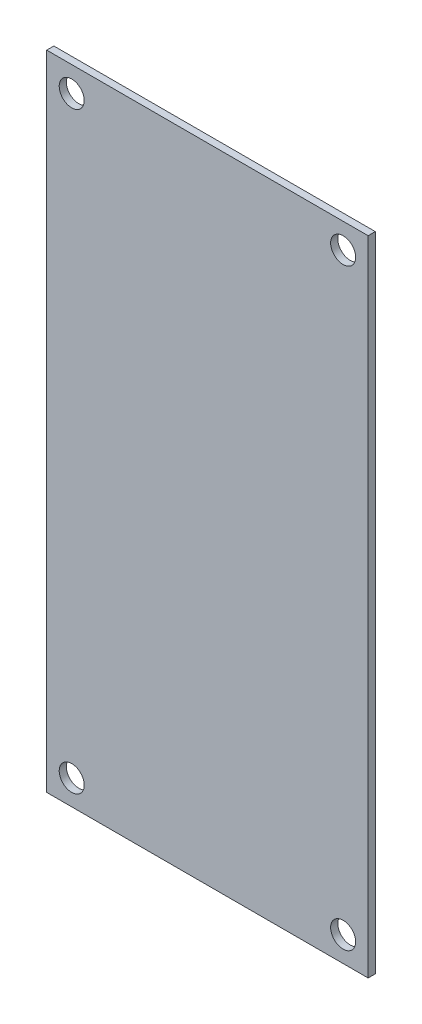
from build123d import *

# Parameters (mm, degrees)
SKETCH1_W           = 90
SKETCH1_H           = 180
BOSS_EXTRUDE1_DEPTH = 2
SKETCH2_R           = 3.5
CUT_EXTRUDE1_DEPTH  = 2
SKETCH3_R           = 3.5
CUT_EXTRUDE2_DEPTH  = 2


with BuildPart() as part:
    # Sketch1 → Boss-Extrude1 (new body)
    with BuildSketch(Plane.XY):
        Rectangle(SKETCH1_W, SKETCH1_H)
    extrude(amount=BOSS_EXTRUDE1_DEPTH)

    # Sketch2 → Cut-Extrude1 (cut)
    with BuildSketch(Plane(origin=(0, 0, 0), x_dir=(-1, 0, 0), z_dir=(0, 0, -1))):
        with Locations((-38, 83)):
            Circle(SKETCH2_R)
        with Locations(Location((38, 83, 0), (0, 0, 180))):
            Circle(SKETCH2_R)
    extrude(amount=-CUT_EXTRUDE1_DEPTH, mode=Mode.SUBTRACT)

    # Sketch3 → Cut-Extrude2 (cut)
    with BuildSketch(Plane(origin=(0, 0, 0), x_dir=(-1, 0, 0), z_dir=(0, 0, -1))):
        with Locations((-38, -83)):
            Circle(SKETCH3_R)
        with Locations(Location((38, -83, 0), (0, 0, 180))):
            Circle(SKETCH3_R)
    extrude(amount=-CUT_EXTRUDE2_DEPTH, mode=Mode.SUBTRACT)


solid = part.part
